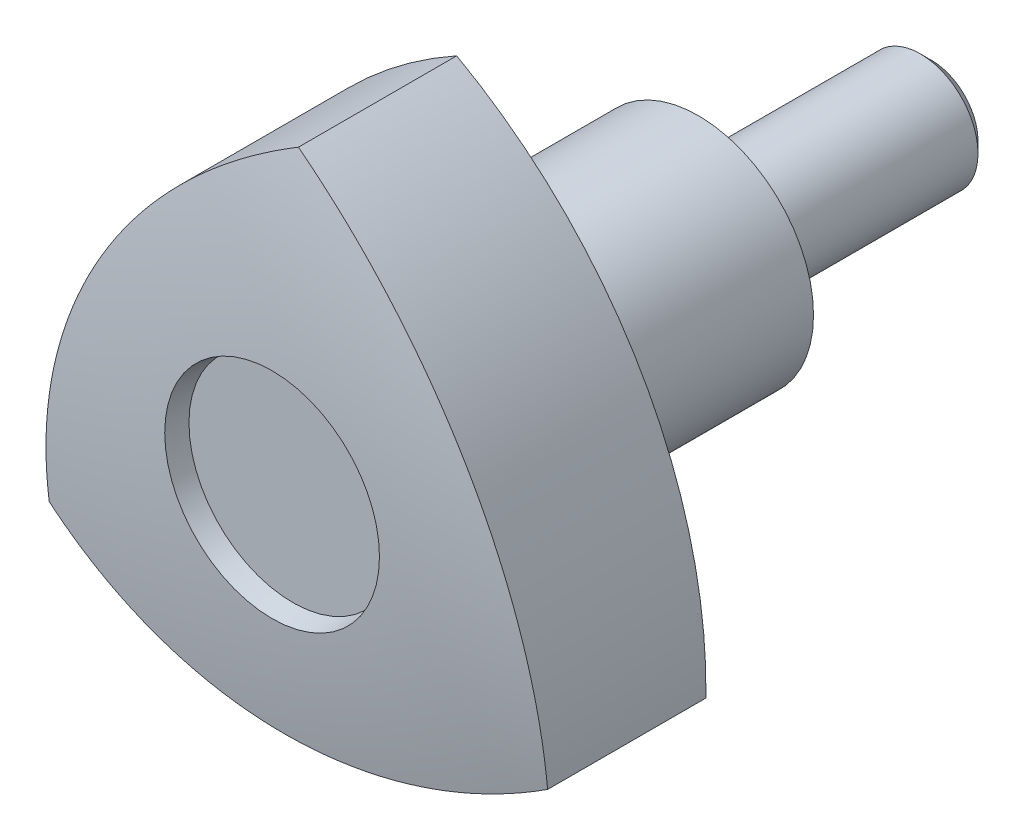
ISO-10303-21;
HEADER;
FILE_DESCRIPTION(('STEP AP214'),'2;1');
FILE_NAME('part.step','',(''),(''),'','','');
FILE_SCHEMA(('AUTOMOTIVE_DESIGN { 1 0 10303 214 1 1 1 1 }'));
ENDSEC;
DATA;
#1=APPLICATION_CONTEXT('core data for automotive mechanical design processes');
#2=APPLICATION_PROTOCOL_DEFINITION('international standard','automotive_design',2000,#1);
#3=PRODUCT_CONTEXT('',#1,'mechanical');
#4=PRODUCT('Part','Part','',(#3));
#5=PRODUCT_RELATED_PRODUCT_CATEGORY('part','',(#4));
#6=PRODUCT_DEFINITION_FORMATION('','',#4);
#7=PRODUCT_DEFINITION_CONTEXT('part definition',#1,'design');
#8=PRODUCT_DEFINITION('design','',#6,#7);
#9=PRODUCT_DEFINITION_SHAPE('','',#8);
#10=(LENGTH_UNIT() NAMED_UNIT(*) SI_UNIT(.MILLI.,.METRE.));
#11=(NAMED_UNIT(*) PLANE_ANGLE_UNIT() SI_UNIT($,.RADIAN.));
#12=(NAMED_UNIT(*) SI_UNIT($,.STERADIAN.) SOLID_ANGLE_UNIT());
#13=UNCERTAINTY_MEASURE_WITH_UNIT(LENGTH_MEASURE(1.E-05),#10,'distance_accuracy_value','');
#14=(GEOMETRIC_REPRESENTATION_CONTEXT(3) GLOBAL_UNCERTAINTY_ASSIGNED_CONTEXT((#13)) GLOBAL_UNIT_ASSIGNED_CONTEXT((#10,
#11,#12)) REPRESENTATION_CONTEXT('',''));
#15=CARTESIAN_POINT('',(0.,0.,0.));
#16=DIRECTION('',(0.,0.,1.));
#17=DIRECTION('',(1.,0.,0.));
#18=AXIS2_PLACEMENT_3D('',#15,#16,#17);
#19=CARTESIAN_POINT('',(0.,-5.2,17.));
#20=DIRECTION('',(0.,0.,-1.));
#21=DIRECTION('',(1.,0.,0.));
#22=AXIS2_PLACEMENT_3D('',#19,#20,#21);
#23=PLANE('',#22);
#24=CARTESIAN_POINT('',(0.,0.,17.));
#25=DIRECTION('',(0.,0.,1.));
#26=DIRECTION('',(-1.,0.,0.));
#27=AXIS2_PLACEMENT_3D('',#24,#25,#26);
#28=CIRCLE('',#27,5.2);
#29=CARTESIAN_POINT('',(-5.2,0.,17.));
#30=VERTEX_POINT('',#29);
#31=EDGE_CURVE('E19',#30,#30,#28,.T.);
#32=ORIENTED_EDGE('',*,*,#31,.T.);
#33=EDGE_LOOP('',(#32));
#34=FACE_BOUND('',#33,.T.);
#35=ADVANCED_FACE('F14',(#34),#23,.F.);
#36=CARTESIAN_POINT('',(0.,0.,27.3333333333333));
#37=DIRECTION('',(0.,0.,1.));
#38=DIRECTION('',(-1.,0.,0.));
#39=AXIS2_PLACEMENT_3D('',#36,#37,#38);
#40=CONICAL_SURFACE('',#39,7.02204546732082,0.174532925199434);
#41=CARTESIAN_POINT('',(0.,0.,27.3333333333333));
#42=DIRECTION('',(0.,0.,1.));
#43=DIRECTION('',(-1.,0.,0.));
#44=AXIS2_PLACEMENT_3D('',#41,#42,#43);
#45=CIRCLE('',#44,7.02204546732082);
#46=CARTESIAN_POINT('',(-7.02204546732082,0.,27.3333333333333));
#47=VERTEX_POINT('',#46);
#48=EDGE_CURVE('E138',#47,#47,#45,.T.);
#49=ORIENTED_EDGE('',*,*,#48,.T.);
#50=EDGE_LOOP('',(#49));
#51=FACE_BOUND('',#50,.T.);
#52=ORIENTED_EDGE('',*,*,#31,.F.);
#53=EDGE_LOOP('',(#52));
#54=FACE_BOUND('',#53,.T.);
#55=ADVANCED_FACE('F146',(#51,#54),#40,.F.);
#56=CARTESIAN_POINT('',(0.,-0.000999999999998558,27.3333333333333));
#57=DIRECTION('',(0.,0.,1.));
#58=DIRECTION('',(-1.,0.,0.));
#59=AXIS2_PLACEMENT_3D('',#56,#57,#58);
#60=PLANE('',#59);
#61=CARTESIAN_POINT('',(0.,0.,27.3333333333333));
#62=DIRECTION('',(0.,0.,-1.));
#63=DIRECTION('',(1.,0.,0.));
#64=AXIS2_PLACEMENT_3D('',#61,#62,#63);
#65=CIRCLE('',#64,0.000999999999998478);
#66=CARTESIAN_POINT('',(0.000999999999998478,0.,27.3333333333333));
#67=VERTEX_POINT('',#66);
#68=EDGE_CURVE('E136',#67,#67,#65,.F.);
#69=ORIENTED_EDGE('',*,*,#68,.T.);
#70=EDGE_LOOP('',(#69));
#71=FACE_BOUND('',#70,.T.);
#72=ORIENTED_EDGE('',*,*,#48,.F.);
#73=EDGE_LOOP('',(#72));
#74=FACE_BOUND('',#73,.T.);
#75=ADVANCED_FACE('F148',(#71,#74),#60,.F.);
#76=CARTESIAN_POINT('',(0.,0.,17.));
#77=DIRECTION('',(0.,0.,-1.));
#78=DIRECTION('',(1.,0.,0.));
#79=AXIS2_PLACEMENT_3D('',#76,#77,#78);
#80=CYLINDRICAL_SURFACE('',#79,0.000999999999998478);
#81=CARTESIAN_POINT('',(0.,0.,28.4));
#82=DIRECTION('',(0.,0.,-1.));
#83=DIRECTION('',(1.,0.,0.));
#84=AXIS2_PLACEMENT_3D('',#81,#82,#83);
#85=CIRCLE('',#84,0.000999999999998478);
#86=CARTESIAN_POINT('',(0.000999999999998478,0.,28.4));
#87=VERTEX_POINT('',#86);
#88=EDGE_CURVE('E133',#87,#87,#85,.F.);
#89=ORIENTED_EDGE('',*,*,#88,.T.);
#90=EDGE_LOOP('',(#89));
#91=FACE_BOUND('',#90,.T.);
#92=ORIENTED_EDGE('',*,*,#68,.F.);
#93=EDGE_LOOP('',(#92));
#94=FACE_BOUND('',#93,.T.);
#95=ADVANCED_FACE('F155',(#91,#94),#80,.F.);
#96=CARTESIAN_POINT('',(0.,0.,-16.));
#97=DIRECTION('',(0.,0.,1.));
#98=DIRECTION('',(-1.,0.,0.));
#99=AXIS2_PLACEMENT_3D('',#96,#97,#98);
#100=PLANE('',#99);
#101=CARTESIAN_POINT('',(0.,0.,-16.0000000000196));
#102=DIRECTION('',(0.,0.,1.));
#103=DIRECTION('',(-1.,0.,0.));
#104=AXIS2_PLACEMENT_3D('',#101,#102,#103);
#105=CIRCLE('',#104,3.23300000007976);
#106=CARTESIAN_POINT('',(-3.23300000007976,0.,-16.0000000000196));
#107=VERTEX_POINT('',#106);
#108=EDGE_CURVE('E130',#107,#107,#105,.T.);
#109=ORIENTED_EDGE('',*,*,#108,.F.);
#110=EDGE_LOOP('',(#109));
#111=FACE_BOUND('',#110,.T.);
#112=ADVANCED_FACE('F211',(#111),#100,.F.);
#113=CARTESIAN_POINT('',(0.,-7.2101275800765,28.4));
#114=DIRECTION('',(0.,0.,-1.));
#115=DIRECTION('',(1.,0.,0.));
#116=AXIS2_PLACEMENT_3D('',#113,#114,#115);
#117=PLANE('',#116);
#118=CARTESIAN_POINT('',(0.,0.,28.4));
#119=DIRECTION('',(0.,0.,1.));
#120=DIRECTION('',(-1.,0.,0.));
#121=AXIS2_PLACEMENT_3D('',#118,#119,#120);
#122=CIRCLE('',#121,7.21012758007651);
#123=CARTESIAN_POINT('',(-7.21012758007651,0.,28.4));
#124=VERTEX_POINT('',#123);
#125=EDGE_CURVE('E82',#124,#124,#122,.T.);
#126=ORIENTED_EDGE('',*,*,#125,.T.);
#127=EDGE_LOOP('',(#126));
#128=FACE_BOUND('',#127,.T.);
#129=ORIENTED_EDGE('',*,*,#88,.F.);
#130=EDGE_LOOP('',(#129));
#131=FACE_BOUND('',#130,.T.);
#132=ADVANCED_FACE('F207',(#128,#131),#117,.F.);
#133=CARTESIAN_POINT('',(0.,0.,-15.2330000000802));
#134=DIRECTION('',(0.,0.,1.));
#135=DIRECTION('',(-1.,0.,0.));
#136=AXIS2_PLACEMENT_3D('',#133,#134,#135);
#137=CONICAL_SURFACE('',#136,4.0000000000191,0.785398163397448);
#138=ORIENTED_EDGE('',*,*,#108,.T.);
#139=EDGE_LOOP('',(#138));
#140=FACE_BOUND('',#139,.T.);
#141=CARTESIAN_POINT('',(0.,0.,-15.233));
#142=DIRECTION('',(0.,0.,-1.));
#143=DIRECTION('',(1.,0.,0.));
#144=AXIS2_PLACEMENT_3D('',#141,#142,#143);
#145=CIRCLE('',#144,4.);
#146=CARTESIAN_POINT('',(4.,0.,-15.233));
#147=VERTEX_POINT('',#146);
#148=EDGE_CURVE('E77',#147,#147,#145,.F.);
#149=ORIENTED_EDGE('',*,*,#148,.F.);
#150=EDGE_LOOP('',(#149));
#151=FACE_BOUND('',#150,.T.);
#152=ADVANCED_FACE('F201',(#140,#151),#137,.T.);
#153=CARTESIAN_POINT('',(0.,0.,29.8316989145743));
#154=DIRECTION('',(0.,0.,1.));
#155=DIRECTION('',(-1.,0.,0.));
#156=AXIS2_PLACEMENT_3D('',#153,#154,#155);
#157=CONICAL_SURFACE('',#156,7.4625747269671,0.174532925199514);
#158=CARTESIAN_POINT('',(0.,0.,29.8316989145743));
#159=DIRECTION('',(0.,0.,-1.));
#160=DIRECTION('',(1.,0.,0.));
#161=AXIS2_PLACEMENT_3D('',#158,#159,#160);
#162=CIRCLE('',#161,7.46257472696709);
#163=CARTESIAN_POINT('',(7.46257472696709,0.,29.8316989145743));
#164=VERTEX_POINT('',#163);
#165=EDGE_CURVE('E74',#164,#164,#162,.T.);
#166=ORIENTED_EDGE('',*,*,#165,.F.);
#167=EDGE_LOOP('',(#166));
#168=FACE_BOUND('',#167,.T.);
#169=ORIENTED_EDGE('',*,*,#125,.F.);
#170=EDGE_LOOP('',(#169));
#171=FACE_BOUND('',#170,.T.);
#172=ADVANCED_FACE('F196',(#168,#171),#157,.F.);
#173=CARTESIAN_POINT('',(0.,0.,17.));
#174=DIRECTION('',(0.,0.,-1.));
#175=DIRECTION('',(1.,0.,0.));
#176=AXIS2_PLACEMENT_3D('',#173,#174,#175);
#177=CYLINDRICAL_SURFACE('',#176,4.);
#178=ORIENTED_EDGE('',*,*,#148,.T.);
#179=EDGE_LOOP('',(#178));
#180=FACE_BOUND('',#179,.T.);
#181=CARTESIAN_POINT('',(0.,0.,0.));
#182=DIRECTION('',(0.,0.,-1.));
#183=DIRECTION('',(1.,0.,0.));
#184=AXIS2_PLACEMENT_3D('',#181,#182,#183);
#185=CIRCLE('',#184,4.);
#186=CARTESIAN_POINT('',(4.,0.,0.));
#187=VERTEX_POINT('',#186);
#188=EDGE_CURVE('E59',#187,#187,#185,.T.);
#189=ORIENTED_EDGE('',*,*,#188,.T.);
#190=EDGE_LOOP('',(#189));
#191=FACE_BOUND('',#190,.T.);
#192=ADVANCED_FACE('F191',(#180,#191),#177,.T.);
#193=CARTESIAN_POINT('',(0.,0.,-52.2083333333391));
#194=DIRECTION('',(0.,0.,1.));
#195=DIRECTION('',(-1.,0.,0.));
#196=AXIS2_PLACEMENT_3D('',#193,#194,#195);
#197=DEGENERATE_TOROIDAL_SURFACE('',#196,1.87916666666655,82.2298080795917,.T.);
#198=ORIENTED_EDGE('',*,*,#165,.T.);
#199=EDGE_LOOP('',(#198));
#200=FACE_BOUND('',#199,.T.);
#201=CARTESIAN_POINT('',(0.,20.,28.));
#202=CARTESIAN_POINT('',(0.372642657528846,19.7932630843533,28.0467066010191));
#203=CARTESIAN_POINT('',(0.74147156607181,19.5793830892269,28.0918331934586));
#204=CARTESIAN_POINT('',(1.47101156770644,19.1375865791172,28.178894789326));
#205=CARTESIAN_POINT('',(1.83172263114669,18.9096700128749,28.2208297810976));
#206=CARTESIAN_POINT('',(2.90076609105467,18.2053565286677,28.3417798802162));
#207=CARTESIAN_POINT('',(3.59619057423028,17.7082949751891,28.4159628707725));
#208=CARTESIAN_POINT('',(4.94790509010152,16.6620571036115,28.5511708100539));
#209=CARTESIAN_POINT('',(5.60419538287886,16.1128811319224,28.6121958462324));
#210=CARTESIAN_POINT('',(6.87366086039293,14.9654936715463,28.7209726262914));
#211=CARTESIAN_POINT('',(7.48683405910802,14.3672799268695,28.7687237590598));
#212=CARTESIAN_POINT('',(8.71865863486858,13.0700716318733,28.8545535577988));
#213=CARTESIAN_POINT('',(9.33294869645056,12.366845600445,28.8913945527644));
#214=CARTESIAN_POINT('',(10.5012836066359,10.9113370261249,28.9492833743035));
#215=CARTESIAN_POINT('',(11.0553238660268,10.1590507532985,28.9703299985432));
#216=CARTESIAN_POINT('',(12.0991453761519,8.61069429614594,28.996665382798));
#217=CARTESIAN_POINT('',(12.588915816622,7.81461677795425,29.0019514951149));
#218=CARTESIAN_POINT('',(13.5005090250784,6.18456766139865,28.9967711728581));
#219=CARTESIAN_POINT('',(13.9223353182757,5.35059803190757,28.9863055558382));
#220=CARTESIAN_POINT('',(14.692719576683,3.65593233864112,28.9497108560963));
#221=CARTESIAN_POINT('',(15.0417071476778,2.79542945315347,28.9236773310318));
#222=CARTESIAN_POINT('',(15.6672761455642,1.04897441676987,28.8559880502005));
#223=CARTESIAN_POINT('',(15.9438491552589,0.16301932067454,28.8143304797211));
#224=CARTESIAN_POINT('',(16.4224738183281,-1.62689638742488,28.7154571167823));
#225=CARTESIAN_POINT('',(16.6246054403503,-2.5308365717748,28.6582581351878));
#226=CARTESIAN_POINT('',(16.9534969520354,-4.35087123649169,28.5284012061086));
#227=CARTESIAN_POINT('',(17.0802911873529,-5.26695998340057,28.4557503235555));
#228=CARTESIAN_POINT('',(17.2305634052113,-6.82078728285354,28.3200368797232));
#229=CARTESIAN_POINT('',(17.2738628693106,-7.45703003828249,28.2609528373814));
#230=CARTESIAN_POINT('',(17.3242365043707,-8.72906049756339,28.1357415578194));
#231=CARTESIAN_POINT('',(17.3313778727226,-9.36484684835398,28.0696276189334));
#232=CARTESIAN_POINT('',(17.3205080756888,-10.,28.));
#233=B_SPLINE_CURVE_WITH_KNOTS('',3,(#201,#202,#203,#204,#205,#206,#207,#208,#209,#210,#211,
#212,#213,#214,#215,#216,#217,#218,#219,#220,#221,#222,#223,#224,#225,#226,#227,#228,#229,#230,
#231,#232),.UNSPECIFIED.,.F.,.F.,(4,2,2,2,2,2,2,2,2,2,2,2,2,2,2,4),(0.,1.28593682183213,
2.5718783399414,5.14313559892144,7.71437576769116,10.2857342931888,13.0857434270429,
15.8859656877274,18.6866583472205,21.4872056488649,24.2707368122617,27.0545913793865,
29.835446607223,32.6150330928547,34.5353707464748,36.4521382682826),.UNSPECIFIED.);
#234=CARTESIAN_POINT('',(0.,20.,28.));
#235=VERTEX_POINT('',#234);
#236=CARTESIAN_POINT('',(17.3205080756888,-10.,28.));
#237=VERTEX_POINT('',#236);
#238=EDGE_CURVE('E49',#235,#237,#233,.T.);
#239=ORIENTED_EDGE('',*,*,#238,.F.);
#240=CARTESIAN_POINT('',(-17.3205080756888,-10.,28.));
#241=CARTESIAN_POINT('',(-17.3277899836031,-9.57391353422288,28.0467066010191));
#242=CARTESIAN_POINT('',(-17.3269789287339,-9.14755833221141,28.0918331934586));
#243=CARTESIAN_POINT('',(-17.3091419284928,-8.29485990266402,28.178894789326));
#244=CARTESIAN_POINT('',(-17.2921159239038,-7.86851667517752,28.2208297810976));
#245=CARTESIAN_POINT('',(-17.2166842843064,-6.59054113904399,28.3417798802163));
#246=CARTESIAN_POINT('',(-17.1339285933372,-5.73975509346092,28.4159628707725));
#247=CARTESIAN_POINT('',(-16.9037172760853,-4.04601704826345,28.5511708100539));
#248=CARTESIAN_POINT('',(-16.7562620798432,-3.2030649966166,28.6121958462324));
#249=CARTESIAN_POINT('',(-16.3973281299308,-1.52998191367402,28.7209726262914));
#250=CARTESIAN_POINT('',(-16.1858464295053,-0.699851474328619,28.7687237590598));
#251=CARTESIAN_POINT('',(-15.6783433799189,1.01554404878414,28.8545535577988));
#252=CARTESIAN_POINT('',(-15.3764768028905,1.89914786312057,28.8913945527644));
#253=CARTESIAN_POINT('',(-14.7001368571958,3.63870986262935,28.9492833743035));
#254=CARTESIAN_POINT('',(-14.3256579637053,4.49466593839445,28.9703299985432));
#255=CARTESIAN_POINT('',(-13.5066526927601,6.1728201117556,28.996665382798));
#256=CARTESIAN_POINT('',(-13.0621145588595,6.99501251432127,29.0019514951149));
#257=CARTESIAN_POINT('',(-12.1062472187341,8.59949994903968,28.9967711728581));
#258=CARTESIAN_POINT('',(-11.5949214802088,9.38179704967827,28.9863055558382));
#259=CARTESIAN_POINT('',(-10.5124900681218,10.8963022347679,28.9497108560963));
#260=CARTESIAN_POINT('',(-9.94176649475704,11.6287857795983,28.9236773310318));
#261=CARTESIAN_POINT('',(-8.74207656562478,13.0437719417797,28.8559880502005));
#262=CARTESIAN_POINT('',(-8.11310345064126,13.726268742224,28.8143304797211));
#263=CARTESIAN_POINT('',(-6.80230330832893,15.0357277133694,28.7154571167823));
#264=CARTESIAN_POINT('',(-6.12053395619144,15.6627489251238,28.6582581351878));
#265=CARTESIAN_POINT('',(-4.70878345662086,16.8575946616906,28.5284012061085));
#266=CARTESIAN_POINT('',(-3.97882444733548,17.4254460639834,28.4557503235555));
#267=CARTESIAN_POINT('',(-2.70830664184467,18.3324992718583,28.3200368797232));
#268=CARTESIAN_POINT('',(-2.17895398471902,18.688119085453,28.2609528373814));
#269=CARTESIAN_POINT('',(-1.10253011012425,19.3677591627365,28.1357415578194));
#270=CARTESIAN_POINT('',(-0.555493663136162,19.6918369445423,28.0696276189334));
#271=CARTESIAN_POINT('',(0.,20.,28.));
#272=B_SPLINE_CURVE_WITH_KNOTS('',3,(#240,#241,#242,#243,#244,#245,#246,#247,#248,#249,#250,
#251,#252,#253,#254,#255,#256,#257,#258,#259,#260,#261,#262,#263,#264,#265,#266,#267,#268,#269,
#270,#271),.UNSPECIFIED.,.F.,.F.,(4,2,2,2,2,2,2,2,2,2,2,2,2,2,2,4),(0.,1.28593682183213,
2.5718783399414,5.14313559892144,7.71437576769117,10.2857342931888,13.0857434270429,
15.8859656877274,18.6866583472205,21.4872056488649,24.2707368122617,27.0545913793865,
29.835446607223,32.6150330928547,34.5353707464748,36.4521382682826),.UNSPECIFIED.);
#273=CARTESIAN_POINT('',(-17.3205080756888,-10.,28.));
#274=VERTEX_POINT('',#273);
#275=EDGE_CURVE('E58',#274,#235,#272,.T.);
#276=ORIENTED_EDGE('',*,*,#275,.F.);
#277=CARTESIAN_POINT('',(17.3205080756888,-10.,28.));
#278=CARTESIAN_POINT('',(16.9551473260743,-10.2193495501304,28.0467066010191));
#279=CARTESIAN_POINT('',(16.5855073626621,-10.4318247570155,28.0918331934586));
#280=CARTESIAN_POINT('',(15.8381303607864,-10.8427266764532,28.178894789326));
#281=CARTESIAN_POINT('',(15.4603932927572,-11.0411533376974,28.2208297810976));
#282=CARTESIAN_POINT('',(14.3159181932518,-11.6148153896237,28.3417798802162));
#283=CARTESIAN_POINT('',(13.5377380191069,-11.9685398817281,28.4159628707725));
#284=CARTESIAN_POINT('',(11.9558121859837,-12.616040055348,28.5511708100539));
#285=CARTESIAN_POINT('',(11.1520666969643,-12.9098161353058,28.6121958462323));
#286=CARTESIAN_POINT('',(9.52366726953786,-13.4355117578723,28.7209726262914));
#287=CARTESIAN_POINT('',(8.69901237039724,-13.6674284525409,28.7687237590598));
#288=CARTESIAN_POINT('',(6.9596847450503,-14.0856156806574,28.8545535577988));
#289=CARTESIAN_POINT('',(6.04352810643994,-14.2659934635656,28.8913945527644));
#290=CARTESIAN_POINT('',(4.19885325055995,-14.5500468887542,28.9492833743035));
#291=CARTESIAN_POINT('',(3.27033409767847,-14.6537166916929,28.9703299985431));
#292=CARTESIAN_POINT('',(1.40750731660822,-14.7835144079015,28.996665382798));
#293=CARTESIAN_POINT('',(0.473198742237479,-14.8096292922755,29.0019514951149));
#294=CARTESIAN_POINT('',(-1.39426180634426,-14.7840676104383,28.9967711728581));
#295=CARTESIAN_POINT('',(-2.32741383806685,-14.7323950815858,28.9863055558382));
#296=CARTESIAN_POINT('',(-4.18022950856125,-14.552234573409,28.9497108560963));
#297=CARTESIAN_POINT('',(-5.09994065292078,-14.4242152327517,28.9236773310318));
#298=CARTESIAN_POINT('',(-6.92519957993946,-14.0927463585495,28.8559880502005));
#299=CARTESIAN_POINT('',(-7.83074570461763,-13.8892880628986,28.8143304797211));
#300=CARTESIAN_POINT('',(-9.62017050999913,-13.4088313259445,28.7154571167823));
#301=CARTESIAN_POINT('',(-10.5040714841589,-13.131912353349,28.6582581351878));
#302=CARTESIAN_POINT('',(-12.2447134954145,-12.5067234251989,28.5284012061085));
#303=CARTESIAN_POINT('',(-13.1014667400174,-12.1584860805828,28.4557503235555));
#304=CARTESIAN_POINT('',(-14.5222567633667,-11.5117119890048,28.3200368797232));
#305=CARTESIAN_POINT('',(-15.0949088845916,-11.2310890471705,28.2609528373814));
#306=CARTESIAN_POINT('',(-16.2217063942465,-10.6386986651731,28.1357415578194));
#307=CARTESIAN_POINT('',(-16.7758842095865,-10.3269900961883,28.0696276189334));
#308=CARTESIAN_POINT('',(-17.3205080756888,-10.,28.));
#309=B_SPLINE_CURVE_WITH_KNOTS('',3,(#277,#278,#279,#280,#281,#282,#283,#284,#285,#286,#287,
#288,#289,#290,#291,#292,#293,#294,#295,#296,#297,#298,#299,#300,#301,#302,#303,#304,#305,#306,
#307,#308),.UNSPECIFIED.,.F.,.F.,(4,2,2,2,2,2,2,2,2,2,2,2,2,2,2,4),(0.,1.28593682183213,
2.5718783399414,5.14313559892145,7.71437576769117,10.2857342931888,13.0857434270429,
15.8859656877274,18.6866583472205,21.4872056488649,24.2707368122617,27.0545913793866,
29.8354466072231,32.6150330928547,34.5353707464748,36.4521382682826),.UNSPECIFIED.);
#310=EDGE_CURVE('E62',#237,#274,#309,.T.);
#311=ORIENTED_EDGE('',*,*,#310,.F.);
#312=EDGE_LOOP('',(#239,#276,#311));
#313=FACE_BOUND('',#312,.T.);
#314=ADVANCED_FACE('F16',(#200,#313),#197,.T.);
#315=CARTESIAN_POINT('',(0.,-4.,0.));
#316=DIRECTION('',(0.,0.,1.));
#317=DIRECTION('',(-1.,0.,0.));
#318=AXIS2_PLACEMENT_3D('',#315,#316,#317);
#319=PLANE('',#318);
#320=ORIENTED_EDGE('',*,*,#188,.F.);
#321=EDGE_LOOP('',(#320));
#322=FACE_BOUND('',#321,.T.);
#323=CARTESIAN_POINT('',(0.,0.,0.));
#324=DIRECTION('',(0.,0.,-1.));
#325=DIRECTION('',(1.,0.,0.));
#326=AXIS2_PLACEMENT_3D('',#323,#324,#325);
#327=CIRCLE('',#326,5.2);
#328=CARTESIAN_POINT('',(5.2,0.,0.));
#329=VERTEX_POINT('',#328);
#330=EDGE_CURVE('E94',#329,#329,#327,.F.);
#331=ORIENTED_EDGE('',*,*,#330,.F.);
#332=EDGE_LOOP('',(#331));
#333=FACE_BOUND('',#332,.T.);
#334=ADVANCED_FACE('F119',(#322,#333),#319,.F.);
#335=CARTESIAN_POINT('',(-16.3245788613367,-9.425,40.));
#336=DIRECTION('',(0.,0.,1.));
#337=DIRECTION('',(-1.,0.,0.));
#338=AXIS2_PLACEMENT_3D('',#335,#336,#337);
#339=CYLINDRICAL_SURFACE('',#338,33.65);
#340=DIRECTION('',(0.,0.,1.));
#341=VECTOR('',#340,1.);
#342=CARTESIAN_POINT('',(17.3205080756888,-10.,40.));
#343=LINE('',#342,#341);
#344=CARTESIAN_POINT('',(17.3205080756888,-10.,17.));
#345=VERTEX_POINT('',#344);
#346=EDGE_CURVE('E54',#345,#237,#343,.T.);
#347=ORIENTED_EDGE('',*,*,#346,.F.);
#348=CARTESIAN_POINT('',(-16.3245788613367,-9.425,17.));
#349=DIRECTION('',(0.,0.,1.));
#350=DIRECTION('',(-1.,0.,0.));
#351=AXIS2_PLACEMENT_3D('',#348,#349,#350);
#352=CIRCLE('',#351,33.65);
#353=CARTESIAN_POINT('',(0.,20.,17.));
#354=VERTEX_POINT('',#353);
#355=EDGE_CURVE('E92',#345,#354,#352,.T.);
#356=ORIENTED_EDGE('',*,*,#355,.T.);
#357=DIRECTION('',(0.,0.,1.));
#358=VECTOR('',#357,1.);
#359=CARTESIAN_POINT('',(0.,20.,40.));
#360=LINE('',#359,#358);
#361=EDGE_CURVE('E56',#235,#354,#360,.F.);
#362=ORIENTED_EDGE('',*,*,#361,.F.);
#363=ORIENTED_EDGE('',*,*,#238,.T.);
#364=EDGE_LOOP('',(#347,#356,#362,#363));
#365=FACE_BOUND('',#364,.T.);
#366=ADVANCED_FACE('F52',(#365),#339,.T.);
#367=CARTESIAN_POINT('',(16.3245788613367,-9.425,40.));
#368=DIRECTION('',(0.,0.,1.));
#369=DIRECTION('',(-1.,0.,0.));
#370=AXIS2_PLACEMENT_3D('',#367,#368,#369);
#371=CYLINDRICAL_SURFACE('',#370,33.65);
#372=ORIENTED_EDGE('',*,*,#361,.T.);
#373=CARTESIAN_POINT('',(16.3245788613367,-9.425,17.));
#374=DIRECTION('',(0.,0.,1.));
#375=DIRECTION('',(-1.,0.,0.));
#376=AXIS2_PLACEMENT_3D('',#373,#374,#375);
#377=CIRCLE('',#376,33.65);
#378=CARTESIAN_POINT('',(-17.3205080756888,-10.,17.));
#379=VERTEX_POINT('',#378);
#380=EDGE_CURVE('E34',#354,#379,#377,.T.);
#381=ORIENTED_EDGE('',*,*,#380,.T.);
#382=DIRECTION('',(0.,0.,1.));
#383=VECTOR('',#382,1.);
#384=CARTESIAN_POINT('',(-17.3205080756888,-10.,40.));
#385=LINE('',#384,#383);
#386=EDGE_CURVE('E64',#274,#379,#385,.F.);
#387=ORIENTED_EDGE('',*,*,#386,.F.);
#388=ORIENTED_EDGE('',*,*,#275,.T.);
#389=EDGE_LOOP('',(#372,#381,#387,#388));
#390=FACE_BOUND('',#389,.T.);
#391=ADVANCED_FACE('F111',(#390),#371,.T.);
#392=CARTESIAN_POINT('',(0.,18.85,40.));
#393=DIRECTION('',(0.,0.,1.));
#394=DIRECTION('',(-1.,0.,0.));
#395=AXIS2_PLACEMENT_3D('',#392,#393,#394);
#396=CYLINDRICAL_SURFACE('',#395,33.65);
#397=ORIENTED_EDGE('',*,*,#386,.T.);
#398=CARTESIAN_POINT('',(0.,18.85,17.));
#399=DIRECTION('',(0.,0.,1.));
#400=DIRECTION('',(-1.,0.,0.));
#401=AXIS2_PLACEMENT_3D('',#398,#399,#400);
#402=CIRCLE('',#401,33.65);
#403=EDGE_CURVE('E68',#379,#345,#402,.T.);
#404=ORIENTED_EDGE('',*,*,#403,.T.);
#405=ORIENTED_EDGE('',*,*,#346,.T.);
#406=ORIENTED_EDGE('',*,*,#310,.T.);
#407=EDGE_LOOP('',(#397,#404,#405,#406));
#408=FACE_BOUND('',#407,.T.);
#409=ADVANCED_FACE('F66',(#408),#396,.T.);
#410=CARTESIAN_POINT('',(0.,0.,17.));
#411=DIRECTION('',(0.,0.,-1.));
#412=DIRECTION('',(1.,0.,0.));
#413=AXIS2_PLACEMENT_3D('',#410,#411,#412);
#414=CYLINDRICAL_SURFACE('',#413,5.2);
#415=ORIENTED_EDGE('',*,*,#330,.T.);
#416=EDGE_LOOP('',(#415));
#417=FACE_BOUND('',#416,.T.);
#418=CARTESIAN_POINT('',(0.,0.,0.2));
#419=DIRECTION('',(0.,0.,-1.));
#420=DIRECTION('',(1.,0.,0.));
#421=AXIS2_PLACEMENT_3D('',#418,#419,#420);
#422=CIRCLE('',#421,5.2);
#423=CARTESIAN_POINT('',(5.2,0.,0.2));
#424=VERTEX_POINT('',#423);
#425=EDGE_CURVE('E87',#424,#424,#422,.T.);
#426=ORIENTED_EDGE('',*,*,#425,.T.);
#427=EDGE_LOOP('',(#426));
#428=FACE_BOUND('',#427,.T.);
#429=ADVANCED_FACE('F110',(#417,#428),#414,.T.);
#430=CARTESIAN_POINT('',(0.,-8.,17.));
#431=DIRECTION('',(0.,0.,1.));
#432=DIRECTION('',(-1.,0.,0.));
#433=AXIS2_PLACEMENT_3D('',#430,#431,#432);
#434=PLANE('',#433);
#435=CARTESIAN_POINT('',(0.,0.,17.));
#436=DIRECTION('',(0.,0.,-1.));
#437=DIRECTION('',(1.,0.,0.));
#438=AXIS2_PLACEMENT_3D('',#435,#436,#437);
#439=CIRCLE('',#438,8.);
#440=CARTESIAN_POINT('',(8.,0.,17.));
#441=VERTEX_POINT('',#440);
#442=EDGE_CURVE('E25',#441,#441,#439,.T.);
#443=ORIENTED_EDGE('',*,*,#442,.F.);
#444=EDGE_LOOP('',(#443));
#445=FACE_BOUND('',#444,.T.);
#446=ORIENTED_EDGE('',*,*,#380,.F.);
#447=ORIENTED_EDGE('',*,*,#355,.F.);
#448=ORIENTED_EDGE('',*,*,#403,.F.);
#449=EDGE_LOOP('',(#446,#447,#448));
#450=FACE_BOUND('',#449,.T.);
#451=ADVANCED_FACE('F166',(#445,#450),#434,.F.);
#452=CARTESIAN_POINT('',(0.,-5.2,0.2));
#453=DIRECTION('',(0.,0.,1.));
#454=DIRECTION('',(-1.,0.,0.));
#455=AXIS2_PLACEMENT_3D('',#452,#453,#454);
#456=PLANE('',#455);
#457=ORIENTED_EDGE('',*,*,#425,.F.);
#458=EDGE_LOOP('',(#457));
#459=FACE_BOUND('',#458,.T.);
#460=CARTESIAN_POINT('',(0.,0.,0.2));
#461=DIRECTION('',(0.,0.,-1.));
#462=DIRECTION('',(1.,0.,0.));
#463=AXIS2_PLACEMENT_3D('',#460,#461,#462);
#464=CIRCLE('',#463,8.);
#465=CARTESIAN_POINT('',(8.,0.,0.2));
#466=VERTEX_POINT('',#465);
#467=EDGE_CURVE('E9',#466,#466,#464,.F.);
#468=ORIENTED_EDGE('',*,*,#467,.F.);
#469=EDGE_LOOP('',(#468));
#470=FACE_BOUND('',#469,.T.);
#471=ADVANCED_FACE('F160',(#459,#470),#456,.F.);
#472=CARTESIAN_POINT('',(0.,0.,17.));
#473=DIRECTION('',(0.,0.,-1.));
#474=DIRECTION('',(1.,0.,0.));
#475=AXIS2_PLACEMENT_3D('',#472,#473,#474);
#476=CYLINDRICAL_SURFACE('',#475,8.);
#477=ORIENTED_EDGE('',*,*,#467,.T.);
#478=EDGE_LOOP('',(#477));
#479=FACE_BOUND('',#478,.T.);
#480=ORIENTED_EDGE('',*,*,#442,.T.);
#481=EDGE_LOOP('',(#480));
#482=FACE_BOUND('',#481,.T.);
#483=ADVANCED_FACE('F158',(#479,#482),#476,.T.);
#484=CLOSED_SHELL('',(#35,#55,#75,#95,#112,#132,#152,#172,#192,#314,#334,#366,#391,#409,#429,
#451,#471,#483));
#485=MANIFOLD_SOLID_BREP('B1',#484);
#486=ADVANCED_BREP_SHAPE_REPRESENTATION('',(#18,#485),#14);
#487=SHAPE_DEFINITION_REPRESENTATION(#9,#486);
ENDSEC;
END-ISO-10303-21;
